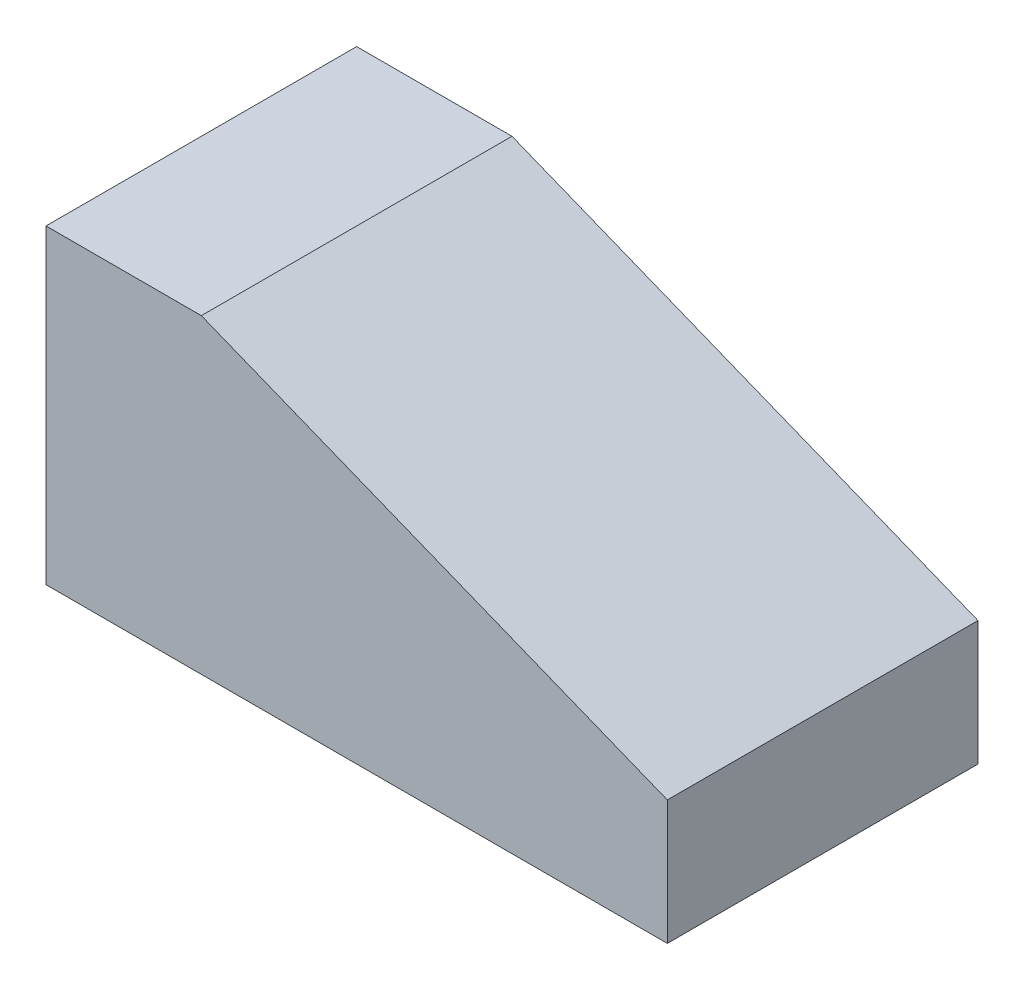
from build123d import *

# Parameters (mm, degrees)
BOSS_EXTRUDE1_DEPTH = 50


with BuildPart() as part:
    # Sketch1 → Boss-Extrude1 (new body)
    with BuildSketch(Plane.XY):
        Polygon((0, 0), (100, 0), (100, 20), (25, 50), (0, 50), align=None)
    extrude(amount=BOSS_EXTRUDE1_DEPTH)


solid = part.part
